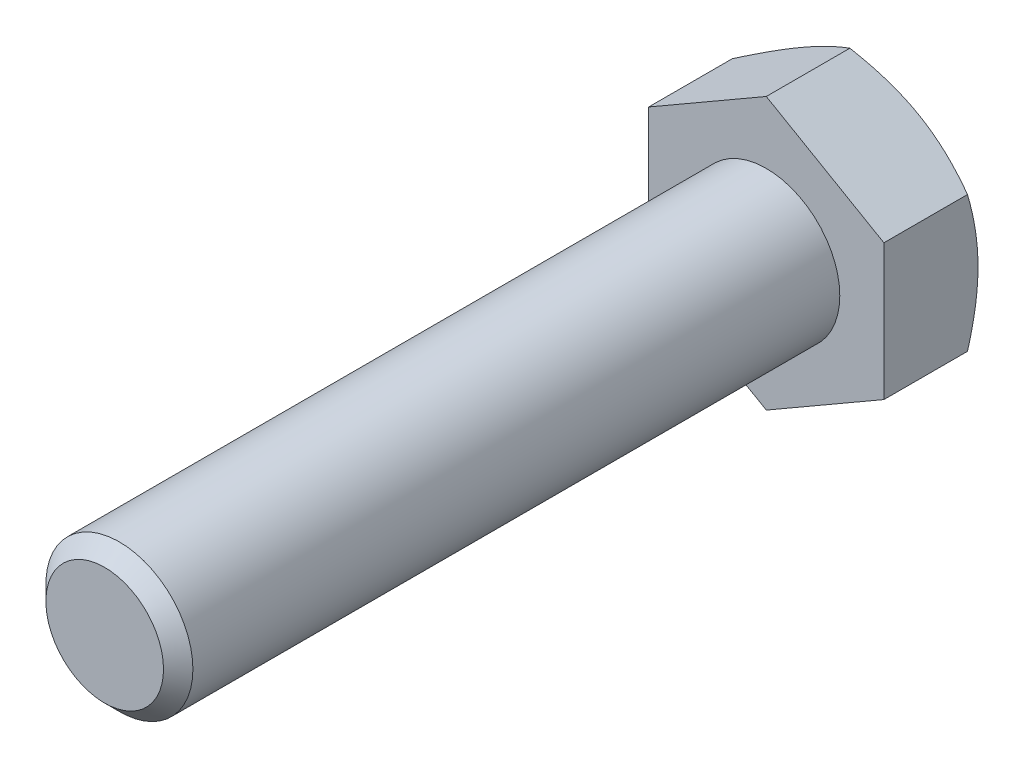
from build123d import *

# Parameters (mm, degrees)
ESQUISSE1_W        = 5
ESQUISSE1_H        = 45
CHANFREIN1_SIZE    = 1
BOSS_EXTRU_1_DEPTH = 6.4


with BuildPart() as part:
    # Esquisse1 → Base-R_volution (revolve)
    with BuildSketch(Plane(origin=(0, 0, 0), x_dir=(1, 0, 0), z_dir=(0, 1, 0))):
        with Locations((2.5, -22.5)):
            Rectangle(ESQUISSE1_W, ESQUISSE1_H)
    revolve(axis=Axis((0, 0, 0), (0, 0, 1)))

    # Chanfrein1
    chanfrein1_edges = [part.edges().sort_by_distance(p)[0] for p in [
        (-5, 0, 45),
    ]]
    chamfer(chanfrein1_edges, length=CHANFREIN1_SIZE)

    # Esquisse6 → Boss.-Extru.1 (add)
    with BuildSketch(Plane.XY):
        Polygon((8, -4.618802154), (8, 4.618802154), (0, 9.237604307), (-8, 4.618802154), (-8, -4.618802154), (0, -9.237604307), align=None)
    extrude(amount=-BOSS_EXTRU_1_DEPTH)

    # Esquisse7 → Enl_vement de mati_re-R_volution1 (revolve, cut)
    with BuildSketch(Plane(origin=(0, 0, 0), x_dir=(1, 0, 0), z_dir=(0, 1, 0))):
        Polygon((-8, 6.4), (-19.085125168, 6.4), (-19.085125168, 0), align=None)
    revolve(axis=Axis((0, 0, -6.239446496), (0, 0, 1)), mode=Mode.SUBTRACT)


solid = part.part
